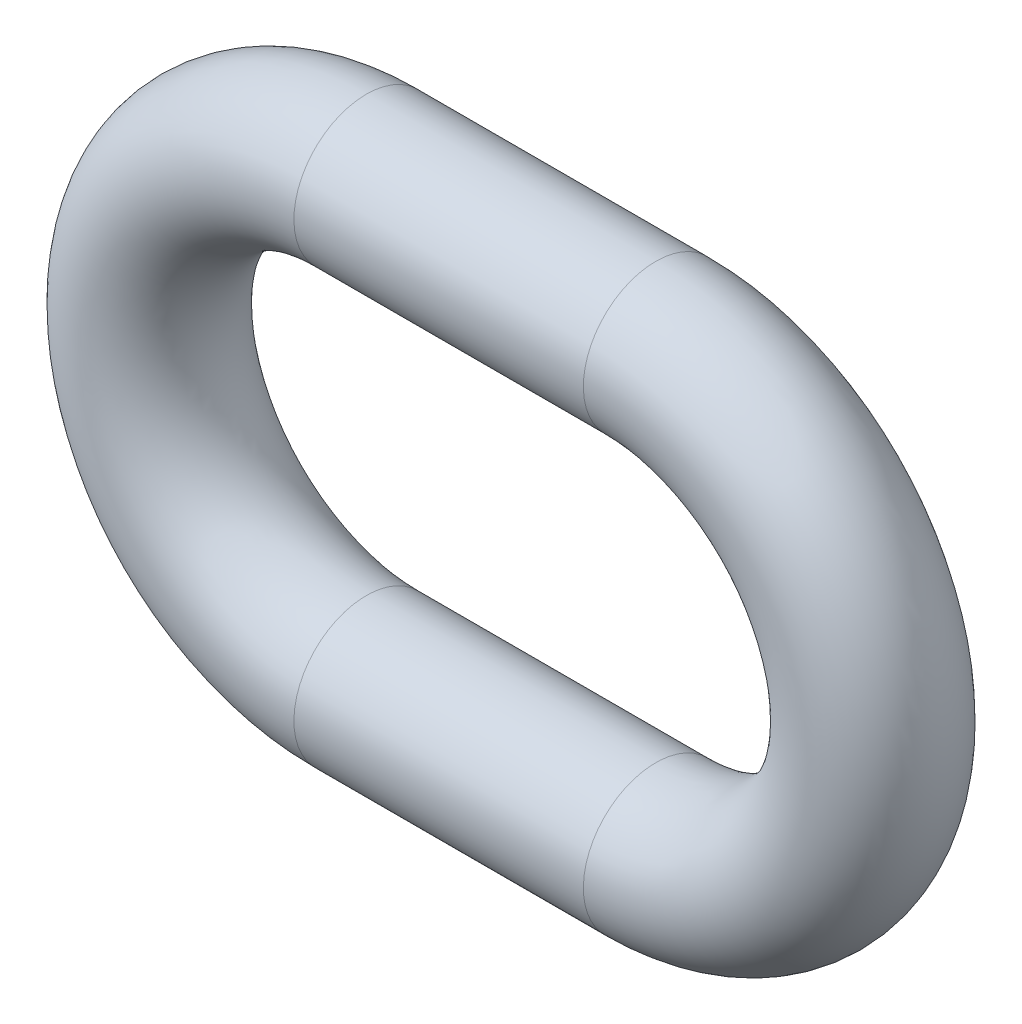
ISO-10303-21;
HEADER;
FILE_DESCRIPTION(('STEP AP214'),'2;1');
FILE_NAME('part.step','',(''),(''),'','','');
FILE_SCHEMA(('AUTOMOTIVE_DESIGN { 1 0 10303 214 1 1 1 1 }'));
ENDSEC;
DATA;
#1=APPLICATION_CONTEXT('core data for automotive mechanical design processes');
#2=APPLICATION_PROTOCOL_DEFINITION('international standard','automotive_design',2000,#1);
#3=PRODUCT_CONTEXT('',#1,'mechanical');
#4=PRODUCT('Part','Part','',(#3));
#5=PRODUCT_RELATED_PRODUCT_CATEGORY('part','',(#4));
#6=PRODUCT_DEFINITION_FORMATION('','',#4);
#7=PRODUCT_DEFINITION_CONTEXT('part definition',#1,'design');
#8=PRODUCT_DEFINITION('design','',#6,#7);
#9=PRODUCT_DEFINITION_SHAPE('','',#8);
#10=(LENGTH_UNIT() NAMED_UNIT(*) SI_UNIT(.MILLI.,.METRE.));
#11=(NAMED_UNIT(*) PLANE_ANGLE_UNIT() SI_UNIT($,.RADIAN.));
#12=(NAMED_UNIT(*) SI_UNIT($,.STERADIAN.) SOLID_ANGLE_UNIT());
#13=UNCERTAINTY_MEASURE_WITH_UNIT(LENGTH_MEASURE(1.E-05),#10,'distance_accuracy_value','');
#14=(GEOMETRIC_REPRESENTATION_CONTEXT(3) GLOBAL_UNCERTAINTY_ASSIGNED_CONTEXT((#13)) GLOBAL_UNIT_ASSIGNED_CONTEXT((#10,
#11,#12)) REPRESENTATION_CONTEXT('',''));
#15=CARTESIAN_POINT('',(0.,0.,0.));
#16=DIRECTION('',(0.,0.,1.));
#17=DIRECTION('',(1.,0.,0.));
#18=AXIS2_PLACEMENT_3D('',#15,#16,#17);
#19=CARTESIAN_POINT('',(10.,0.,0.));
#20=DIRECTION('',(0.,0.,1.));
#21=DIRECTION('',(1.,0.,0.));
#22=AXIS2_PLACEMENT_3D('',#19,#20,#21);
#23=TOROIDAL_SURFACE('',#22,15.,5.);
#24=CARTESIAN_POINT('',(10.,-15.,0.));
#25=DIRECTION('',(-1.,0.,0.));
#26=DIRECTION('',(0.,0.,-1.));
#27=AXIS2_PLACEMENT_3D('',#24,#25,#26);
#28=CIRCLE('',#27,5.);
#29=CARTESIAN_POINT('',(10.,-20.,0.));
#30=VERTEX_POINT('',#29);
#31=EDGE_CURVE('E36',#30,#30,#28,.T.);
#32=CARTESIAN_POINT('',(9.99999999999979,15.,0.));
#33=DIRECTION('',(1.,0.,0.));
#34=DIRECTION('',(0.,0.,-1.));
#35=AXIS2_PLACEMENT_3D('',#32,#33,#34);
#36=CIRCLE('',#35,5.);
#37=CARTESIAN_POINT('',(9.99999999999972,20.,0.));
#38=VERTEX_POINT('',#37);
#39=EDGE_CURVE('E10',#38,#38,#36,.T.);
#40=CARTESIAN_POINT('',(10.,0.,0.));
#41=DIRECTION('',(0.,0.,1.));
#42=DIRECTION('',(1.,0.,0.));
#43=AXIS2_PLACEMENT_3D('',#40,#41,#42);
#44=CIRCLE('',#43,20.);
#45=EDGE_CURVE('',#30,#38,#44,.T.);
#46=ORIENTED_EDGE('',*,*,#31,.F.);
#47=ORIENTED_EDGE('',*,*,#39,.T.);
#48=ORIENTED_EDGE('',*,*,#45,.T.);
#49=ORIENTED_EDGE('',*,*,#45,.F.);
#50=EDGE_LOOP('',(#46,#48,#47,#49));
#51=FACE_BOUND('',#50,.T.);
#52=ADVANCED_FACE('F30',(#51),#23,.T.);
#53=CARTESIAN_POINT('',(-10.,-15.,0.));
#54=DIRECTION('',(1.,0.,0.));
#55=DIRECTION('',(0.,1.,0.));
#56=AXIS2_PLACEMENT_3D('',#53,#54,#55);
#57=CYLINDRICAL_SURFACE('',#56,5.);
#58=CARTESIAN_POINT('',(-10.,-15.,0.));
#59=DIRECTION('',(-1.,0.,0.));
#60=DIRECTION('',(0.,0.,-1.));
#61=AXIS2_PLACEMENT_3D('',#58,#59,#60);
#62=CIRCLE('',#61,5.);
#63=CARTESIAN_POINT('',(-10.,-20.,0.));
#64=VERTEX_POINT('',#63);
#65=EDGE_CURVE('E40',#64,#64,#62,.T.);
#66=ORIENTED_EDGE('',*,*,#65,.F.);
#67=EDGE_LOOP('',(#66));
#68=FACE_BOUND('',#67,.T.);
#69=ORIENTED_EDGE('',*,*,#31,.T.);
#70=EDGE_LOOP('',(#69));
#71=FACE_BOUND('',#70,.T.);
#72=ADVANCED_FACE('F56',(#68,#71),#57,.T.);
#73=CARTESIAN_POINT('',(-10.,0.,0.));
#74=DIRECTION('',(0.,0.,1.));
#75=DIRECTION('',(1.,0.,0.));
#76=AXIS2_PLACEMENT_3D('',#73,#74,#75);
#77=TOROIDAL_SURFACE('',#76,15.,5.);
#78=CARTESIAN_POINT('',(-10.,15.,0.));
#79=DIRECTION('',(1.,0.,0.));
#80=DIRECTION('',(0.,0.,-1.));
#81=AXIS2_PLACEMENT_3D('',#78,#79,#80);
#82=CIRCLE('',#81,5.);
#83=CARTESIAN_POINT('',(-10.,20.,0.));
#84=VERTEX_POINT('',#83);
#85=EDGE_CURVE('E44',#84,#84,#82,.T.);
#86=CARTESIAN_POINT('',(-10.,0.,0.));
#87=DIRECTION('',(0.,0.,1.));
#88=DIRECTION('',(1.,0.,0.));
#89=AXIS2_PLACEMENT_3D('',#86,#87,#88);
#90=CIRCLE('',#89,20.);
#91=EDGE_CURVE('',#84,#64,#90,.T.);
#92=ORIENTED_EDGE('',*,*,#85,.F.);
#93=ORIENTED_EDGE('',*,*,#65,.T.);
#94=ORIENTED_EDGE('',*,*,#91,.T.);
#95=ORIENTED_EDGE('',*,*,#91,.F.);
#96=EDGE_LOOP('',(#92,#94,#93,#95));
#97=FACE_BOUND('',#96,.T.);
#98=ADVANCED_FACE('F53',(#97),#77,.T.);
#99=CARTESIAN_POINT('',(-10.,15.,0.));
#100=DIRECTION('',(1.,0.,0.));
#101=DIRECTION('',(0.,0.,-1.));
#102=AXIS2_PLACEMENT_3D('',#99,#100,#101);
#103=CYLINDRICAL_SURFACE('',#102,5.);
#104=ORIENTED_EDGE('',*,*,#85,.T.);
#105=EDGE_LOOP('',(#104));
#106=FACE_BOUND('',#105,.T.);
#107=ORIENTED_EDGE('',*,*,#39,.F.);
#108=EDGE_LOOP('',(#107));
#109=FACE_BOUND('',#108,.T.);
#110=ADVANCED_FACE('F50',(#106,#109),#103,.T.);
#111=CLOSED_SHELL('',(#52,#72,#98,#110));
#112=MANIFOLD_SOLID_BREP('B2',#111);
#113=ADVANCED_BREP_SHAPE_REPRESENTATION('',(#18,#112),#14);
#114=SHAPE_DEFINITION_REPRESENTATION(#9,#113);
ENDSEC;
END-ISO-10303-21;
